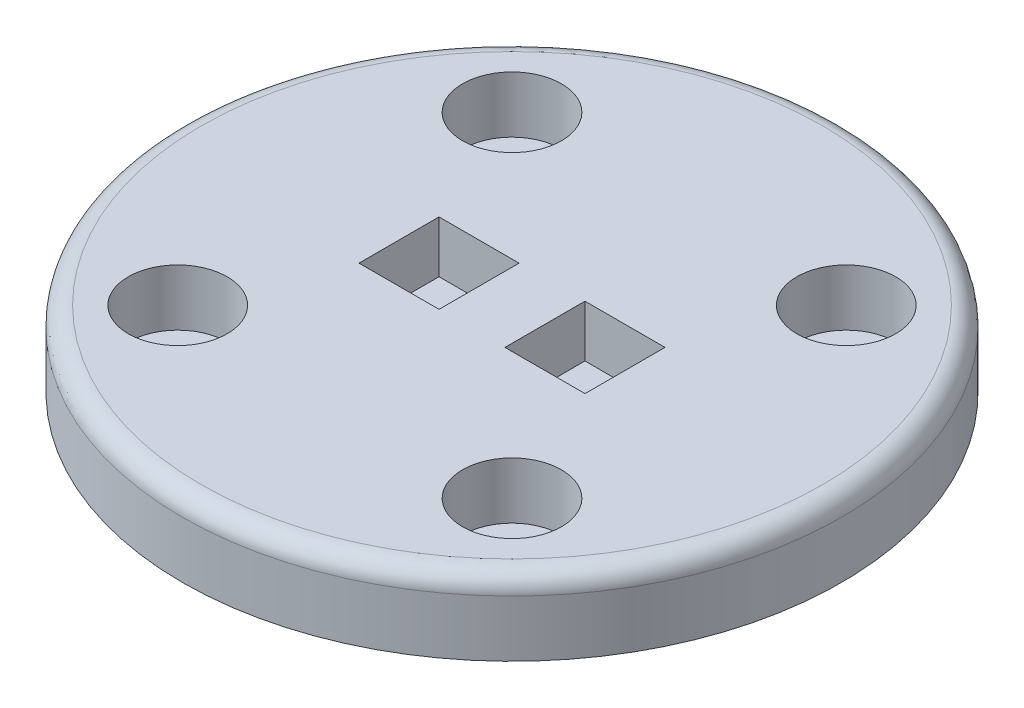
from build123d import *

# Parameters (mm, degrees)
SKETCH1_R           = 35
BOSS_EXTRUDE1_DEPTH = 8
SKETCH2_R           = 5.25
CUT_EXTRUDE1_DEPTH  = 6
SKETCH3_R           = 3.25
CUT_EXTRUDE2_DEPTH  = 2
SKETCH4_W           = 8.5
SKETCH4_H           = 8.5
CUT_EXTRUDE3_DEPTH  = 5.5
FILLET1_R           = 2


with BuildPart() as part:
    # Sketch1 → Boss-Extrude1 (new body)
    with BuildSketch(Plane(origin=(0, 0, 0), x_dir=(1, 0, 0), z_dir=(0, 1, 0))):
        with Locations(Location((0, 0, 0), (0, 0, 270))):
            Circle(SKETCH1_R)
    extrude(amount=BOSS_EXTRUDE1_DEPTH)

    # Sketch2 → Cut-Extrude1 (cut)
    with BuildSketch(Plane(origin=(0, 8, 0), x_dir=(1, 0, 0), z_dir=(0, 1, 0))):
        with Locations(Location((-17.75, 17.75, 0), (0, 0, 270))):
            Circle(SKETCH2_R)
        with Locations(Location((17.75, 17.75, 0), (0, 0, 270))):
            Circle(SKETCH2_R)
        with Locations(Location((17.75, -17.75, 0), (0, 0, 270))):
            Circle(SKETCH2_R)
        with Locations(Location((-17.75, -17.75, 0), (0, 0, 270))):
            Circle(SKETCH2_R)
    extrude(amount=-CUT_EXTRUDE1_DEPTH, mode=Mode.SUBTRACT)

    # Sketch3 → Cut-Extrude2 (cut)
    with BuildSketch(Plane(origin=(0, 2, 0), x_dir=(1, 0, 0), z_dir=(0, 1, 0))):
        with Locations(Location((17.75, 17.75, 0), (0, 0, 270))):
            Circle(SKETCH3_R)
        with Locations(Location((-17.75, 17.75, 0), (0, 0, 270))):
            Circle(SKETCH3_R)
        with Locations(Location((-17.75, -17.75, 0), (0, 0, 270))):
            Circle(SKETCH3_R)
        with Locations(Location((17.75, -17.75, 0), (0, 0, 270))):
            Circle(SKETCH3_R)
    extrude(amount=-CUT_EXTRUDE2_DEPTH, mode=Mode.SUBTRACT)

    # Sketch4 → Cut-Extrude3 (cut)
    with BuildSketch(Plane(origin=(0, 8, 0), x_dir=(1, 0, 0), z_dir=(0, 1, 0))):
        with Locations((-7.75, 0)):
            Rectangle(SKETCH4_W, SKETCH4_H)
        with Locations((7.75, 0)):
            Rectangle(SKETCH4_W, SKETCH4_H)
    extrude(amount=-CUT_EXTRUDE3_DEPTH, mode=Mode.SUBTRACT)

    # Fillet1
    fillet1_edges = [part.edges().sort_by_distance(p)[0] for p in [
        (0, 8, -35),
    ]]
    fillet(fillet1_edges, radius=FILLET1_R)


solid = part.part
